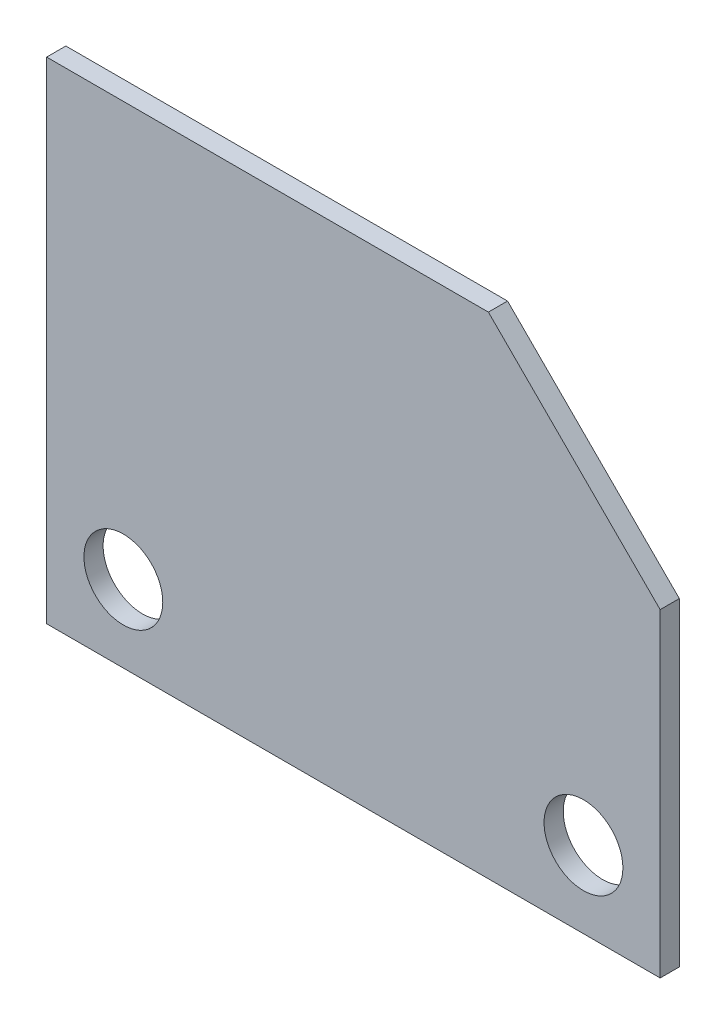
from build123d import *

# Parameters (mm, degrees)
SKETCH1_W                      = 25.4
SKETCH1_H                      = 20.32
EXTRUDE1_DEPTH                 = 0.79375
F_30_0_128500_DIAMETER_HOLE1_D = 3.2639
CHAMFER1_SIZE                  = 7.112


with BuildPart() as part:
    # Sketch1 → Extrude1 (new body)
    with BuildSketch(Plane.XY):
        with Locations((0, 10.16)):
            Rectangle(SKETCH1_W, SKETCH1_H)
    extrude(amount=EXTRUDE1_DEPTH)

    # 30 _0.128500_ Diameter Hole1 (through all)
    with Locations(Plane(origin=(-9.525, 3.175, 0.79375), x_dir=(1, 0, 0), z_dir=(0, 0, 1))):
        with Locations((0, 0), (19.05, 0)):
            Hole(F_30_0_128500_DIAMETER_HOLE1_D / 2)

    # Chamfer1
    chamfer1_edges = [part.edges().sort_by_distance(p)[0] for p in [
        (12.7, 20.32, 0.396875),
    ]]
    chamfer(chamfer1_edges, length=CHAMFER1_SIZE)


solid = part.part
